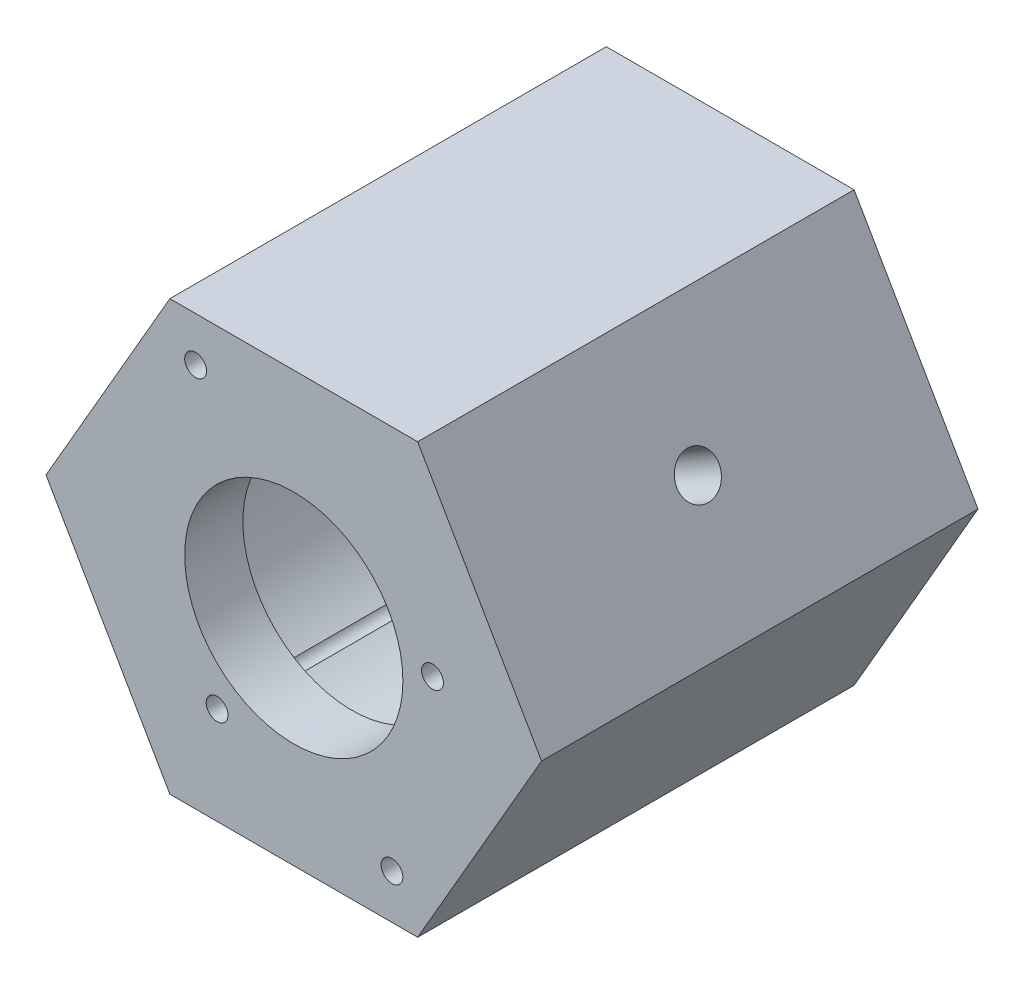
from build123d import *

# Parameters (mm, degrees)
ESQUISSE1_R             = 20.5
BOSS_EXTRU_1_DEPTH      = 30
ESQUISSE2_R             = 2.9
ENL_V_MAT_EXTRU_1_DEPTH = 81.072363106
ESQUISSE3_R             = 21
ESQUISSE3_R_2           = 15
BOSS_EXTRU_2_DEPTH      = 8
ESQUISSE4_R             = 1.5
ENL_V_MAT_EXTRU_2_DEPTH = 76.03721307
ESQUISSE5_R             = 1.5
ENL_V_MAT_EXTRU_3_DEPTH = 76.03721299


with BuildPart() as part:
    # Esquisse1 → Boss.-Extru.1 (new, symmetric)
    with BuildSketch(Plane.XY):
        Polygon((-34.063665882, 0), (-17.031832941, -29.5), (17.031832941, -29.5), (34.063665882, 0), (17.031832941, 29.5), (-17.031832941, 29.5), align=None)
        Circle(ESQUISSE1_R, mode=Mode.SUBTRACT)
    extrude(amount=BOSS_EXTRU_1_DEPTH, both=True)

    # Esquisse2 → Enl_v. mat.-Extru.1 (cut, through all)
    with BuildSketch(Plane(origin=(25.547749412, 14.75, 0), x_dir=(0, 0, -1), z_dir=(0.8660254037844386, 0.5000000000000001, 0))):
        with Locations(Location((0, 0, 0), (0, 0, 90))):
            Circle(ESQUISSE2_R)
    extrude(amount=-ENL_V_MAT_EXTRU_1_DEPTH, mode=Mode.SUBTRACT)

    # Esquisse3 → Boss.-Extru.2 (add)
    with BuildSketch(Plane.XY.offset(30)):
        Circle(ESQUISSE3_R)
        Circle(ESQUISSE3_R_2, mode=Mode.SUBTRACT)
    extrude(amount=-BOSS_EXTRU_2_DEPTH)

    # Esquisse4 → Enl_v. mat.-Extru.2 (cut, through all)
    with BuildSketch(Plane.XY.offset(30)):
        with Locations((-10.543796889, -16.095910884)):
            Circle(ESQUISSE4_R)
        with Locations(Location((19.071140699, 2.557653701, 0), (0, 0, 333.449451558))):
            Circle(ESQUISSE4_R)
    extrude(amount=-ENL_V_MAT_EXTRU_2_DEPTH, mode=Mode.SUBTRACT)

    # Esquisse5 → Enl_v. mat.-Extru.3 (cut, through all)
    with BuildSketch(Plane(origin=(0, 0, -30), x_dir=(-1, 0, 0), z_dir=(0, 0, -1))):
        with Locations((-13.5, -23.382685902)):
            Circle(ESQUISSE5_R)
        with Locations(Location((13.5, 23.382685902, 0), (0, 0, 180))):
            Circle(ESQUISSE5_R)
    extrude(amount=-ENL_V_MAT_EXTRU_3_DEPTH, mode=Mode.SUBTRACT)


solid = part.part
